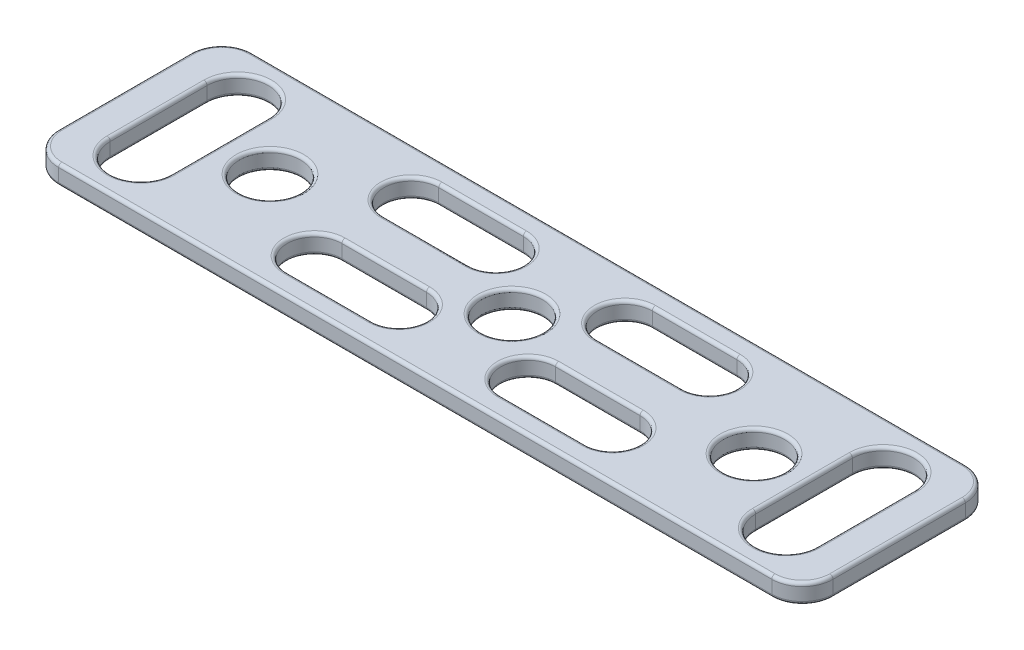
from build123d import *

# Parameters (mm, degrees)
EXTRUDE1_DEPTH       = 1.524
CUT_EXTRUDE1_DEPTH   = 63.854608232
CUT_EXTRUDE2_DEPTH   = 63.854608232
SKETCH4_R            = 2.413
CUT_EXTRUDE3_DEPTH   = 63.854608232
MIRROR2_COPY_1_DEPTH = 63.854608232
LPATTERN1_COUNT      = 2
LPATTERN1_PITCH      = 19.05
LPATTERN1_COL_COUNT  = 2
LPATTERN1_COL_PITCH  = 19.05
FILLET1_R            = 0.254


with BuildPart() as part:
    # Sketch1 → Extrude1 (new body)
    with BuildSketch(Plane(origin=(0, 0, 0), x_dir=(1, 0, 0), z_dir=(0, 1, 0))):
        with BuildLine():
            Line((2.413, 0), (58.547, 0))
            ThreePointArc((58.547, 0), (60.253248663, 0.706751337), (60.96, 2.413))
            Line((60.96, 2.413), (60.96, 12.827))
            ThreePointArc((60.96, 12.827), (60.253248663, 14.533248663), (58.547, 15.24))
            Line((58.547, 15.24), (2.413, 15.24))
            ThreePointArc((2.413, 15.24), (0.706751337, 14.533248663), (0, 12.827))
            Line((0, 12.827), (0, 2.413))
            ThreePointArc((0, 2.413), (0.706751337, 0.706751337), (2.413, 0))
        make_face()
    extrude(amount=EXTRUDE1_DEPTH)

    # Sketch2 → Cut-Extrude1 (cut, through all)
    with BuildSketch(Plane(origin=(0, 1.524, 0), x_dir=(-1, 0, 0), z_dir=(0, 1, 0))):
        with BuildLine():
            Line((-18.7452, -5.969), (-25.4, -5.969))
            ThreePointArc((-25.4, -5.969), (-27.559, -3.81), (-25.4, -1.651))
            Line((-25.4, -1.651), (-18.7452, -1.651))
            ThreePointArc((-18.7452, -1.651), (-16.5862, -3.81), (-18.7452, -5.969))
        make_face()
    cut_extrude1 = extrude(amount=-CUT_EXTRUDE1_DEPTH, mode=Mode.SUBTRACT)

    # Sketch3 → Cut-Extrude2 (cut, through all)
    with BuildSketch(Plane(origin=(0, 1.524, 0), x_dir=(-1, 0, 0), z_dir=(0, 1, 0))):
        with BuildLine():
            Line((-2.667, -11.43), (-2.667, -3.81))
            ThreePointArc((-2.667, -3.81), (-5.08, -1.397), (-7.493, -3.81))
            Line((-7.493, -3.81), (-7.493, -11.43))
            ThreePointArc((-7.493, -11.43), (-5.08, -13.843), (-2.667, -11.43))
        make_face()
    cut_extrude2 = extrude(amount=-CUT_EXTRUDE2_DEPTH, mode=Mode.SUBTRACT)

    # Sketch4 → Cut-Extrude3 (cut, through all)
    with BuildSketch(Plane(origin=(0, 1.524, 0), x_dir=(-1, 0, 0), z_dir=(0, 1, 0))):
        with Locations(Location((-30.48, -7.62, 0), (0, 0, 90))):
            Circle(SKETCH4_R)
    cut_extrude3 = extrude(amount=-CUT_EXTRUDE3_DEPTH, mode=Mode.SUBTRACT)

    # Mirror1: Cut-Extrude1 across plane
    add(cut_extrude1.mirror(Plane.XY.offset(-7.62)), mode=Mode.SUBTRACT)

    # Mirror2: Cut-Extrude1, Cut-Extrude2 across plane
    add(cut_extrude1.mirror(Plane(origin=(30.48, 0, 0), x_dir=(0, 0, 1), z_dir=(1, 0, 0))), mode=Mode.SUBTRACT)
    add(cut_extrude2.mirror(Plane(origin=(30.48, 0, 0), x_dir=(0, 0, 1), z_dir=(1, 0, 0))), mode=Mode.SUBTRACT)

    # Mirror2 copy 1 sketch → Mirror2 copy 1 (cut, through all)
    with BuildSketch(Plane(origin=(60.96, 1.524, -15.24), x_dir=(1, 0, 0), z_dir=(0, 1, 0))):
        with BuildLine():
            Line((-18.7452, -5.969), (-25.4, -5.969))
            ThreePointArc((-25.4, -5.969), (-27.559, -3.81), (-25.4, -1.651))
            Line((-25.4, -1.651), (-18.7452, -1.651))
            ThreePointArc((-18.7452, -1.651), (-16.5862, -3.81), (-18.7452, -5.969))
        make_face()
    extrude(amount=-MIRROR2_COPY_1_DEPTH, mode=Mode.SUBTRACT)

    # LPattern1: Cut-Extrude3 ×2
    with Locations(*[(i * LPATTERN1_PITCH, 0, 0) for i in range(1, LPATTERN1_COUNT)]):
        add(cut_extrude3, mode=Mode.SUBTRACT)

    # LPattern1 col: Cut-Extrude3 ×2
    with Locations(*[(-i * LPATTERN1_COL_PITCH, 0, 0) for i in range(1, LPATTERN1_COL_COUNT)]):
        add(cut_extrude3, mode=Mode.SUBTRACT)

    # Fillet1
    fillet1_edges = [part.edges().sort_by_distance(p)[0] for p in [
        (0.706751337, 1.524, -0.706751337),
        (44.3738, 1.524, -3.81),
        (38.8874, 1.524, -1.651),
        (33.401, 1.524, -3.81),
        (38.8874, 1.524, -5.969),
        (44.3738, 0, -3.81),
        (38.8874, 0, -1.651),
        (33.401, 0, -3.81),
        (38.8874, 0, -5.969),
        (11.43, 0, -10.033),
        (11.43, 1.524, -10.033),
        (49.53, 0, -10.033),
        (49.53, 1.524, -10.033),
        (30.48, 1.524, 0),
        (60.253248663, 1.524, -0.706751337),
        (60.96, 1.524, -7.62),
        (60.253248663, 1.524, -14.533248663),
        (30.48, 1.524, -15.24),
        (16.5862, 0, -3.81),
        (22.0726, 0, -5.969),
        (27.559, 0, -3.81),
        (22.0726, 0, -1.651),
        (16.5862, 1.524, -3.81),
        (22.0726, 1.524, -1.651),
        (27.559, 1.524, -3.81),
        (22.0726, 1.524, -5.969),
        (0.706751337, 1.524, -14.533248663),
        (5.08, 0, -13.843),
        (7.493, 0, -7.62),
        (5.08, 0, -1.397),
        (2.667, 0, -7.62),
        (5.08, 1.524, -13.843),
        (2.667, 1.524, -7.62),
        (5.08, 1.524, -1.397),
        (7.493, 1.524, -7.62),
        (30.48, 0, -10.033),
        (30.48, 1.524, -10.033),
        (16.5862, 1.524, -11.43),
        (22.0726, 1.524, -13.589),
        (27.559, 1.524, -11.43),
        (22.0726, 1.524, -9.271),
        (16.5862, 0, -11.43),
        (22.0726, 0, -13.589),
        (27.559, 0, -11.43),
        (22.0726, 0, -9.271),
        (30.48, 0, -15.24),
        (0, 1.524, -7.62),
        (60.253248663, 0, -14.533248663),
        (60.96, 0, -7.62),
        (55.88, 1.524, -13.843),
        (58.293, 1.524, -7.62),
        (55.88, 1.524, -1.397),
        (53.467, 1.524, -7.62),
        (55.88, 0, -13.843),
        (58.293, 0, -7.62),
        (55.88, 0, -1.397),
        (53.467, 0, -7.62),
        (60.253248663, 0, -0.706751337),
        (30.48, 0, 0),
        (0.706751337, 0, -0.706751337),
        (44.3738, 0, -11.43),
        (38.8874, 0, -9.271),
        (33.401, 0, -11.43),
        (38.8874, 0, -13.589),
        (44.3738, 1.524, -11.43),
        (38.8874, 1.524, -13.589),
        (0, 0, -7.62),
        (33.401, 1.524, -11.43),
        (38.8874, 1.524, -9.271),
        (0.706751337, 0, -14.533248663),
    ]]
    fillet(fillet1_edges, radius=FILLET1_R)


solid = part.part
